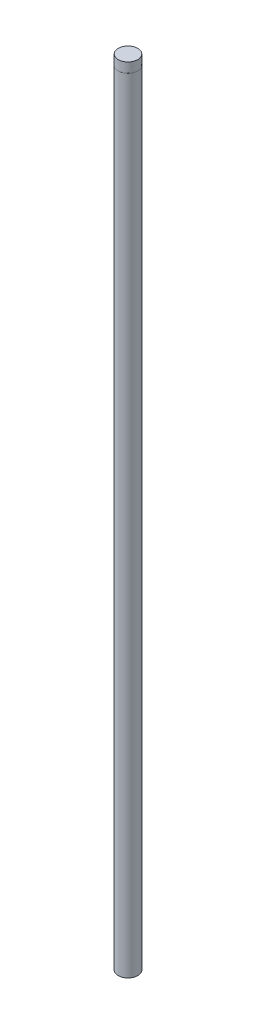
ISO-10303-21;
HEADER;
FILE_DESCRIPTION(('STEP AP214'),'2;1');
FILE_NAME('part.step','',(''),(''),'','','');
FILE_SCHEMA(('AUTOMOTIVE_DESIGN { 1 0 10303 214 1 1 1 1 }'));
ENDSEC;
DATA;
#1=APPLICATION_CONTEXT('core data for automotive mechanical design processes');
#2=APPLICATION_PROTOCOL_DEFINITION('international standard','automotive_design',2000,#1);
#3=PRODUCT_CONTEXT('',#1,'mechanical');
#4=PRODUCT('Part','Part','',(#3));
#5=PRODUCT_RELATED_PRODUCT_CATEGORY('part','',(#4));
#6=PRODUCT_DEFINITION_FORMATION('','',#4);
#7=PRODUCT_DEFINITION_CONTEXT('part definition',#1,'design');
#8=PRODUCT_DEFINITION('design','',#6,#7);
#9=PRODUCT_DEFINITION_SHAPE('','',#8);
#10=(LENGTH_UNIT() NAMED_UNIT(*) SI_UNIT(.MILLI.,.METRE.));
#11=(NAMED_UNIT(*) PLANE_ANGLE_UNIT() SI_UNIT($,.RADIAN.));
#12=(NAMED_UNIT(*) SI_UNIT($,.STERADIAN.) SOLID_ANGLE_UNIT());
#13=UNCERTAINTY_MEASURE_WITH_UNIT(LENGTH_MEASURE(1.E-05),#10,'distance_accuracy_value','');
#14=(GEOMETRIC_REPRESENTATION_CONTEXT(3) GLOBAL_UNCERTAINTY_ASSIGNED_CONTEXT((#13)) GLOBAL_UNIT_ASSIGNED_CONTEXT((#10,
#11,#12)) REPRESENTATION_CONTEXT('',''));
#15=CARTESIAN_POINT('',(0.,0.,0.));
#16=DIRECTION('',(0.,0.,1.));
#17=DIRECTION('',(1.,0.,0.));
#18=AXIS2_PLACEMENT_3D('',#15,#16,#17);
#19=CARTESIAN_POINT('',(0.,886.,0.));
#20=DIRECTION('',(0.,1.,0.));
#21=DIRECTION('',(-1.,0.,0.));
#22=AXIS2_PLACEMENT_3D('',#19,#20,#21);
#23=CYLINDRICAL_SURFACE('',#22,4.99999999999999);
#24=CARTESIAN_POINT('',(0.,486.,0.));
#25=DIRECTION('',(0.,1.,0.));
#26=DIRECTION('',(-1.,0.,0.));
#27=AXIS2_PLACEMENT_3D('',#24,#25,#26);
#28=CIRCLE('',#27,4.99999999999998);
#29=CARTESIAN_POINT('',(-5.00000000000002,486.,0.));
#30=VERTEX_POINT('',#29);
#31=EDGE_CURVE('E47',#30,#30,#28,.T.);
#32=ORIENTED_EDGE('',*,*,#31,.T.);
#33=EDGE_LOOP('',(#32));
#34=FACE_BOUND('',#33,.T.);
#35=CARTESIAN_POINT('',(0.,886.,0.));
#36=DIRECTION('',(0.,1.,0.));
#37=DIRECTION('',(-1.,0.,0.));
#38=AXIS2_PLACEMENT_3D('',#35,#36,#37);
#39=CIRCLE('',#38,5.);
#40=CARTESIAN_POINT('',(-5.0000000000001,886.,0.));
#41=VERTEX_POINT('',#40);
#42=EDGE_CURVE('E10',#41,#41,#39,.T.);
#43=ORIENTED_EDGE('',*,*,#42,.F.);
#44=EDGE_LOOP('',(#43));
#45=FACE_BOUND('',#44,.T.);
#46=ADVANCED_FACE('F33',(#34,#45),#23,.T.);
#47=CARTESIAN_POINT('',(0.,886.,0.));
#48=DIRECTION('',(0.,1.,0.));
#49=DIRECTION('',(-1.,0.,0.));
#50=AXIS2_PLACEMENT_3D('',#47,#48,#49);
#51=PLANE('',#50);
#52=ORIENTED_EDGE('',*,*,#42,.T.);
#53=EDGE_LOOP('',(#52));
#54=FACE_BOUND('',#53,.T.);
#55=CARTESIAN_POINT('',(0.,886.,0.));
#56=DIRECTION('',(0.,1.,0.));
#57=DIRECTION('',(-1.,0.,0.));
#58=AXIS2_PLACEMENT_3D('',#55,#56,#57);
#59=CIRCLE('',#58,4.99000000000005);
#60=CARTESIAN_POINT('',(-4.99000000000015,886.,0.));
#61=VERTEX_POINT('',#60);
#62=EDGE_CURVE('E39',#61,#61,#59,.T.);
#63=ORIENTED_EDGE('',*,*,#62,.F.);
#64=EDGE_LOOP('',(#63));
#65=FACE_BOUND('',#64,.T.);
#66=ADVANCED_FACE('F66',(#54,#65),#51,.T.);
#67=CARTESIAN_POINT('',(0.,886.,0.));
#68=DIRECTION('',(0.,1.,0.));
#69=DIRECTION('',(-1.,0.,0.));
#70=AXIS2_PLACEMENT_3D('',#67,#68,#69);
#71=CYLINDRICAL_SURFACE('',#70,4.99000000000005);
#72=CARTESIAN_POINT('',(-1.00404551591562E-13,891.,0.));
#73=DIRECTION('',(0.,1.,0.));
#74=DIRECTION('',(-1.,0.,0.));
#75=AXIS2_PLACEMENT_3D('',#72,#73,#74);
#76=CIRCLE('',#75,4.99000000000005);
#77=CARTESIAN_POINT('',(-4.99000000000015,891.,0.));
#78=VERTEX_POINT('',#77);
#79=EDGE_CURVE('E43',#78,#78,#76,.T.);
#80=ORIENTED_EDGE('',*,*,#79,.F.);
#81=EDGE_LOOP('',(#80));
#82=FACE_BOUND('',#81,.T.);
#83=ORIENTED_EDGE('',*,*,#62,.T.);
#84=EDGE_LOOP('',(#83));
#85=FACE_BOUND('',#84,.T.);
#86=ADVANCED_FACE('F62',(#82,#85),#71,.T.);
#87=CARTESIAN_POINT('',(0.,891.,0.));
#88=DIRECTION('',(0.,1.,0.));
#89=DIRECTION('',(-1.,0.,0.));
#90=AXIS2_PLACEMENT_3D('',#87,#88,#89);
#91=PLANE('',#90);
#92=ORIENTED_EDGE('',*,*,#79,.T.);
#93=EDGE_LOOP('',(#92));
#94=FACE_BOUND('',#93,.T.);
#95=ADVANCED_FACE('F57',(#94),#91,.T.);
#96=CARTESIAN_POINT('',(0.,486.,0.));
#97=DIRECTION('',(0.,-1.,0.));
#98=DIRECTION('',(1.,0.,0.));
#99=AXIS2_PLACEMENT_3D('',#96,#97,#98);
#100=PLANE('',#99);
#101=ORIENTED_EDGE('',*,*,#31,.F.);
#102=EDGE_LOOP('',(#101));
#103=FACE_BOUND('',#102,.T.);
#104=ADVANCED_FACE('F55',(#103),#100,.T.);
#105=CLOSED_SHELL('',(#46,#66,#86,#95,#104));
#106=MANIFOLD_SOLID_BREP('B2',#105);
#107=ADVANCED_BREP_SHAPE_REPRESENTATION('',(#18,#106),#14);
#108=SHAPE_DEFINITION_REPRESENTATION(#9,#107);
ENDSEC;
END-ISO-10303-21;
